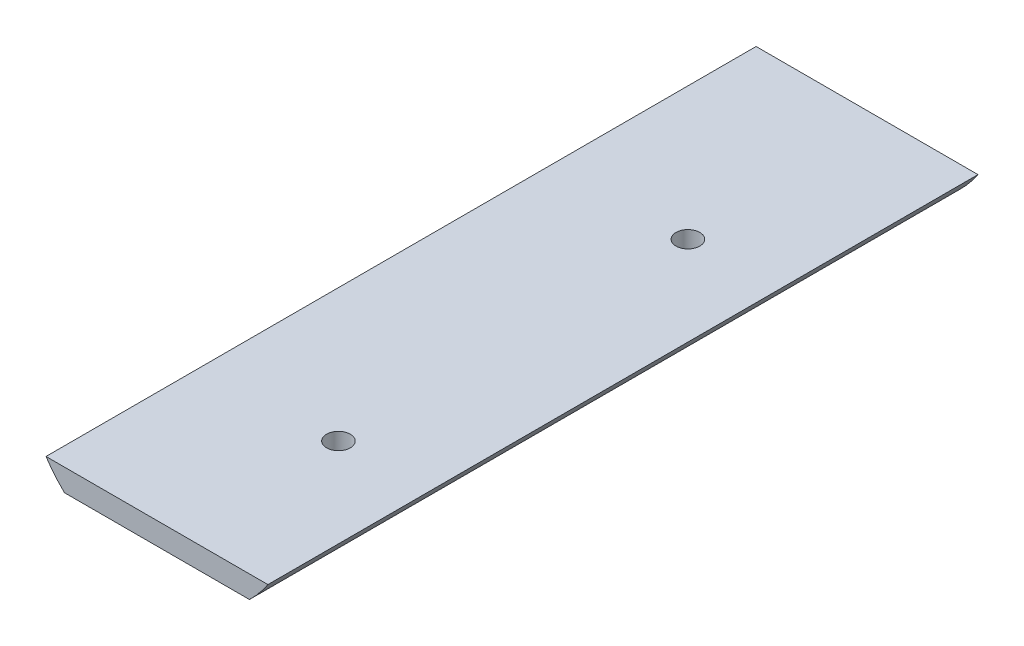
ISO-10303-21;
HEADER;
FILE_DESCRIPTION(('STEP AP214'),'2;1');
FILE_NAME('part.step','',(''),(''),'','','');
FILE_SCHEMA(('AUTOMOTIVE_DESIGN { 1 0 10303 214 1 1 1 1 }'));
ENDSEC;
DATA;
#1=APPLICATION_CONTEXT('core data for automotive mechanical design processes');
#2=APPLICATION_PROTOCOL_DEFINITION('international standard','automotive_design',2000,#1);
#3=PRODUCT_CONTEXT('',#1,'mechanical');
#4=PRODUCT('Part','Part','',(#3));
#5=PRODUCT_RELATED_PRODUCT_CATEGORY('part','',(#4));
#6=PRODUCT_DEFINITION_FORMATION('','',#4);
#7=PRODUCT_DEFINITION_CONTEXT('part definition',#1,'design');
#8=PRODUCT_DEFINITION('design','',#6,#7);
#9=PRODUCT_DEFINITION_SHAPE('','',#8);
#10=(LENGTH_UNIT() NAMED_UNIT(*) SI_UNIT(.MILLI.,.METRE.));
#11=(NAMED_UNIT(*) PLANE_ANGLE_UNIT() SI_UNIT($,.RADIAN.));
#12=(NAMED_UNIT(*) SI_UNIT($,.STERADIAN.) SOLID_ANGLE_UNIT());
#13=UNCERTAINTY_MEASURE_WITH_UNIT(LENGTH_MEASURE(1.E-05),#10,'distance_accuracy_value','');
#14=(GEOMETRIC_REPRESENTATION_CONTEXT(3) GLOBAL_UNCERTAINTY_ASSIGNED_CONTEXT((#13)) GLOBAL_UNIT_ASSIGNED_CONTEXT((#10,
#11,#12)) REPRESENTATION_CONTEXT('',''));
#15=CARTESIAN_POINT('',(0.,0.,0.));
#16=DIRECTION('',(0.,0.,1.));
#17=DIRECTION('',(1.,0.,0.));
#18=AXIS2_PLACEMENT_3D('',#15,#16,#17);
#19=CARTESIAN_POINT('',(-8.01603840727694,-13.3079166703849,161.972952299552));
#20=DIRECTION('',(0.,0.,1.));
#21=DIRECTION('',(-1.,0.,0.));
#22=AXIS2_PLACEMENT_3D('',#19,#20,#21);
#23=CYLINDRICAL_SURFACE('',#22,19.05);
#24=CARTESIAN_POINT('',(-8.01603840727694,-13.3079166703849,161.972952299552));
#25=DIRECTION('',(0.,0.,-1.));
#26=DIRECTION('',(1.,0.,0.));
#27=AXIS2_PLACEMENT_3D('',#24,#25,#26);
#28=CIRCLE('',#27,19.05);
#29=CARTESIAN_POINT('',(7.85896159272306,-23.8382003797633,161.972952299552));
#30=VERTEX_POINT('',#29);
#31=CARTESIAN_POINT('',(5.21527666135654,-27.0132003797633,161.972952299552));
#32=VERTEX_POINT('',#31);
#33=EDGE_CURVE('E38',#30,#32,#28,.T.);
#34=ORIENTED_EDGE('',*,*,#33,.F.);
#35=DIRECTION('',(0.,0.,-1.));
#36=VECTOR('',#35,1.);
#37=CARTESIAN_POINT('',(7.85896159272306,-23.8382003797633,263.572952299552));
#38=LINE('',#37,#36);
#39=CARTESIAN_POINT('',(7.85896159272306,-23.8382003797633,263.572952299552));
#40=VERTEX_POINT('',#39);
#41=EDGE_CURVE('E70',#40,#30,#38,.T.);
#42=ORIENTED_EDGE('',*,*,#41,.F.);
#43=CARTESIAN_POINT('',(-8.01603840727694,-13.3079166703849,263.572952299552));
#44=DIRECTION('',(0.,0.,-1.));
#45=DIRECTION('',(1.,0.,0.));
#46=AXIS2_PLACEMENT_3D('',#43,#44,#45);
#47=CIRCLE('',#46,19.05);
#48=CARTESIAN_POINT('',(5.21527666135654,-27.0132003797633,263.572952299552));
#49=VERTEX_POINT('',#48);
#50=EDGE_CURVE('E53',#40,#49,#47,.T.);
#51=ORIENTED_EDGE('',*,*,#50,.T.);
#52=DIRECTION('',(0.,0.,-1.));
#53=VECTOR('',#52,1.);
#54=CARTESIAN_POINT('',(5.21527666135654,-27.0132003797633,263.572952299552));
#55=LINE('',#54,#53);
#56=EDGE_CURVE('E84',#49,#32,#55,.T.);
#57=ORIENTED_EDGE('',*,*,#56,.T.);
#58=EDGE_LOOP('',(#34,#42,#51,#57));
#59=FACE_BOUND('',#58,.T.);
#60=ADVANCED_FACE('F30',(#59),#23,.T.);
#61=CARTESIAN_POINT('',(-21.2473534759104,-27.0132003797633,263.572952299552));
#62=VERTEX_POINT('',#61);
#63=CARTESIAN_POINT('',(-23.8910384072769,-23.8382003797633,263.572952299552));
#64=VERTEX_POINT('',#63);
#65=EDGE_CURVE('E85',#62,#64,#47,.T.);
#66=ORIENTED_EDGE('',*,*,#65,.T.);
#67=DIRECTION('',(0.,0.,-1.));
#68=VECTOR('',#67,1.);
#69=CARTESIAN_POINT('',(-23.8910384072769,-23.8382003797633,263.572952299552));
#70=LINE('',#69,#68);
#71=CARTESIAN_POINT('',(-23.8910384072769,-23.8382003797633,161.972952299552));
#72=VERTEX_POINT('',#71);
#73=EDGE_CURVE('E45',#64,#72,#70,.T.);
#74=ORIENTED_EDGE('',*,*,#73,.T.);
#75=CARTESIAN_POINT('',(-21.2473534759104,-27.0132003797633,161.972952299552));
#76=VERTEX_POINT('',#75);
#77=EDGE_CURVE('E11',#76,#72,#28,.T.);
#78=ORIENTED_EDGE('',*,*,#77,.F.);
#79=DIRECTION('',(0.,0.,-1.));
#80=VECTOR('',#79,1.);
#81=CARTESIAN_POINT('',(-21.2473534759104,-27.0132003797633,263.572952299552));
#82=LINE('',#81,#80);
#83=EDGE_CURVE('E91',#62,#76,#82,.T.);
#84=ORIENTED_EDGE('',*,*,#83,.F.);
#85=EDGE_LOOP('',(#66,#74,#78,#84));
#86=FACE_BOUND('',#85,.T.);
#87=ADVANCED_FACE('F32',(#86),#23,.T.);
#88=CARTESIAN_POINT('',(-8.01603840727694,-13.3079166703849,161.972952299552));
#89=DIRECTION('',(0.,0.,-1.));
#90=DIRECTION('',(1.,0.,0.));
#91=AXIS2_PLACEMENT_3D('',#88,#89,#90);
#92=PLANE('',#91);
#93=DIRECTION('',(-1.,0.,0.));
#94=VECTOR('',#93,1.);
#95=CARTESIAN_POINT('',(-23.8910384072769,-23.8382003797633,161.972952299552));
#96=LINE('',#95,#94);
#97=EDGE_CURVE('E73',#30,#72,#96,.T.);
#98=ORIENTED_EDGE('',*,*,#97,.F.);
#99=ORIENTED_EDGE('',*,*,#33,.T.);
#100=DIRECTION('',(1.,0.,0.));
#101=VECTOR('',#100,1.);
#102=CARTESIAN_POINT('',(-21.2473534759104,-27.0132003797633,161.972952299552));
#103=LINE('',#102,#101);
#104=EDGE_CURVE('E97',#76,#32,#103,.T.);
#105=ORIENTED_EDGE('',*,*,#104,.F.);
#106=ORIENTED_EDGE('',*,*,#77,.T.);
#107=EDGE_LOOP('',(#98,#99,#105,#106));
#108=FACE_BOUND('',#107,.T.);
#109=ADVANCED_FACE('F78',(#108),#92,.T.);
#110=CARTESIAN_POINT('',(-8.01603840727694,-13.3079166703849,263.572952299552));
#111=DIRECTION('',(0.,0.,-1.));
#112=DIRECTION('',(1.,0.,0.));
#113=AXIS2_PLACEMENT_3D('',#110,#111,#112);
#114=PLANE('',#113);
#115=ORIENTED_EDGE('',*,*,#50,.F.);
#116=DIRECTION('',(-1.,0.,0.));
#117=VECTOR('',#116,1.);
#118=CARTESIAN_POINT('',(-23.8910384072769,-23.8382003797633,263.572952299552));
#119=LINE('',#118,#117);
#120=EDGE_CURVE('E74',#40,#64,#119,.T.);
#121=ORIENTED_EDGE('',*,*,#120,.T.);
#122=ORIENTED_EDGE('',*,*,#65,.F.);
#123=DIRECTION('',(1.,0.,0.));
#124=VECTOR('',#123,1.);
#125=CARTESIAN_POINT('',(-21.2473534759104,-27.0132003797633,263.572952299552));
#126=LINE('',#125,#124);
#127=EDGE_CURVE('E93',#62,#49,#126,.T.);
#128=ORIENTED_EDGE('',*,*,#127,.T.);
#129=EDGE_LOOP('',(#115,#121,#122,#128));
#130=FACE_BOUND('',#129,.T.);
#131=ADVANCED_FACE('F138',(#130),#114,.F.);
#132=CARTESIAN_POINT('',(-21.2473534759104,-27.0132003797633,263.572952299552));
#133=DIRECTION('',(0.,1.,0.));
#134=DIRECTION('',(0.,0.,1.));
#135=AXIS2_PLACEMENT_3D('',#132,#133,#134);
#136=PLANE('',#135);
#137=CARTESIAN_POINT('',(-4.88255602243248,-27.0132003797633,240.740510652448));
#138=DIRECTION('',(0.,1.,0.));
#139=DIRECTION('',(0.,0.,1.));
#140=AXIS2_PLACEMENT_3D('',#137,#138,#139);
#141=CIRCLE('',#140,1.69999999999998);
#142=CARTESIAN_POINT('',(-4.88255602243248,-27.0132003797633,242.440510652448));
#143=VERTEX_POINT('',#142);
#144=EDGE_CURVE('E106',#143,#143,#141,.T.);
#145=ORIENTED_EDGE('',*,*,#144,.T.);
#146=EDGE_LOOP('',(#145));
#147=FACE_BOUND('',#146,.T.);
#148=CARTESIAN_POINT('',(-4.88255602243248,-27.0132003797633,190.740510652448));
#149=DIRECTION('',(0.,1.,0.));
#150=DIRECTION('',(0.,0.,1.));
#151=AXIS2_PLACEMENT_3D('',#148,#149,#150);
#152=CIRCLE('',#151,1.69999999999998);
#153=CARTESIAN_POINT('',(-4.88255602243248,-27.0132003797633,192.440510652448));
#154=VERTEX_POINT('',#153);
#155=EDGE_CURVE('E82',#154,#154,#152,.T.);
#156=ORIENTED_EDGE('',*,*,#155,.T.);
#157=EDGE_LOOP('',(#156));
#158=FACE_BOUND('',#157,.T.);
#159=ORIENTED_EDGE('',*,*,#104,.T.);
#160=ORIENTED_EDGE('',*,*,#56,.F.);
#161=ORIENTED_EDGE('',*,*,#127,.F.);
#162=ORIENTED_EDGE('',*,*,#83,.T.);
#163=EDGE_LOOP('',(#159,#160,#161,#162));
#164=FACE_BOUND('',#163,.T.);
#165=ADVANCED_FACE('F118',(#147,#158,#164),#136,.F.);
#166=CARTESIAN_POINT('',(-23.8910384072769,-23.8382003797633,263.572952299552));
#167=DIRECTION('',(0.,-1.,0.));
#168=DIRECTION('',(0.,0.,-1.));
#169=AXIS2_PLACEMENT_3D('',#166,#167,#168);
#170=PLANE('',#169);
#171=CARTESIAN_POINT('',(-4.88255602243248,-23.8382003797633,240.740510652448));
#172=DIRECTION('',(0.,1.,0.));
#173=DIRECTION('',(0.,0.,1.));
#174=AXIS2_PLACEMENT_3D('',#171,#172,#173);
#175=CIRCLE('',#174,1.69999999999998);
#176=CARTESIAN_POINT('',(-4.88255602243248,-23.8382003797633,242.440510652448));
#177=VERTEX_POINT('',#176);
#178=EDGE_CURVE('E109',#177,#177,#175,.T.);
#179=ORIENTED_EDGE('',*,*,#178,.F.);
#180=EDGE_LOOP('',(#179));
#181=FACE_BOUND('',#180,.T.);
#182=CARTESIAN_POINT('',(-4.88255602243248,-23.8382003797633,190.740510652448));
#183=DIRECTION('',(0.,1.,0.));
#184=DIRECTION('',(0.,0.,1.));
#185=AXIS2_PLACEMENT_3D('',#182,#183,#184);
#186=CIRCLE('',#185,1.69999999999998);
#187=CARTESIAN_POINT('',(-4.88255602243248,-23.8382003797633,192.440510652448));
#188=VERTEX_POINT('',#187);
#189=EDGE_CURVE('E103',#188,#188,#186,.T.);
#190=ORIENTED_EDGE('',*,*,#189,.F.);
#191=EDGE_LOOP('',(#190));
#192=FACE_BOUND('',#191,.T.);
#193=ORIENTED_EDGE('',*,*,#97,.T.);
#194=ORIENTED_EDGE('',*,*,#73,.F.);
#195=ORIENTED_EDGE('',*,*,#120,.F.);
#196=ORIENTED_EDGE('',*,*,#41,.T.);
#197=EDGE_LOOP('',(#193,#194,#195,#196));
#198=FACE_BOUND('',#197,.T.);
#199=ADVANCED_FACE('F72',(#181,#192,#198),#170,.F.);
#200=CARTESIAN_POINT('',(-4.88255602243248,-27.0132003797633,190.740510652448));
#201=DIRECTION('',(0.,1.,0.));
#202=DIRECTION('',(0.,0.,1.));
#203=AXIS2_PLACEMENT_3D('',#200,#201,#202);
#204=CYLINDRICAL_SURFACE('',#203,1.69999999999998);
#205=ORIENTED_EDGE('',*,*,#155,.F.);
#206=EDGE_LOOP('',(#205));
#207=FACE_BOUND('',#206,.T.);
#208=ORIENTED_EDGE('',*,*,#189,.T.);
#209=EDGE_LOOP('',(#208));
#210=FACE_BOUND('',#209,.T.);
#211=ADVANCED_FACE('F117',(#207,#210),#204,.F.);
#212=CARTESIAN_POINT('',(-4.88255602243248,-27.0132003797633,240.740510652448));
#213=DIRECTION('',(0.,1.,0.));
#214=DIRECTION('',(0.,0.,1.));
#215=AXIS2_PLACEMENT_3D('',#212,#213,#214);
#216=CYLINDRICAL_SURFACE('',#215,1.69999999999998);
#217=ORIENTED_EDGE('',*,*,#144,.F.);
#218=EDGE_LOOP('',(#217));
#219=FACE_BOUND('',#218,.T.);
#220=ORIENTED_EDGE('',*,*,#178,.T.);
#221=EDGE_LOOP('',(#220));
#222=FACE_BOUND('',#221,.T.);
#223=ADVANCED_FACE('F113',(#219,#222),#216,.F.);
#224=CLOSED_SHELL('',(#60,#87,#109,#131,#165,#199,#211,#223));
#225=MANIFOLD_SOLID_BREP('B2',#224);
#226=ADVANCED_BREP_SHAPE_REPRESENTATION('',(#18,#225),#14);
#227=SHAPE_DEFINITION_REPRESENTATION(#9,#226);
ENDSEC;
END-ISO-10303-21;
